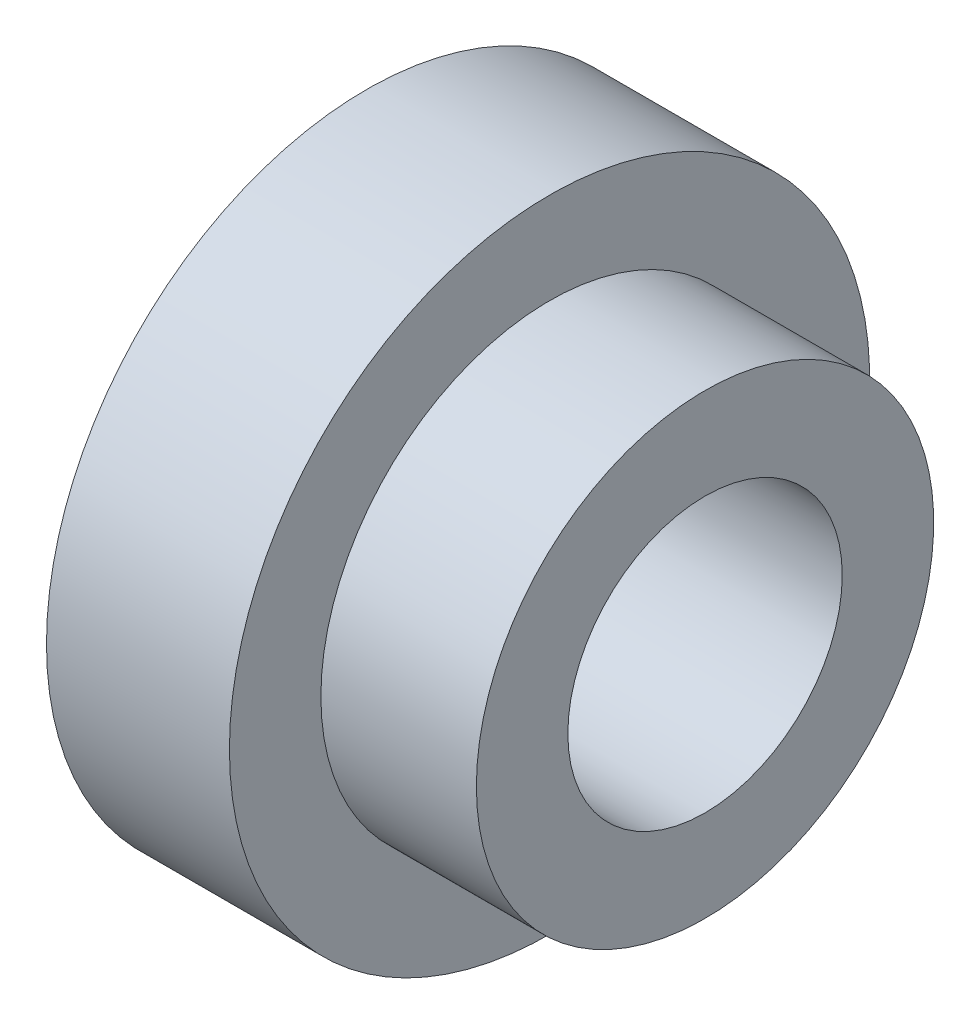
from build123d import *

# Parameters (mm, degrees)
SKETCH2_R          = 3
CUT_EXTRUDE1_DEPTH = 13.359611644


with BuildPart() as part:
    # Sketch1 → Revolve1 (revolve)
    with BuildSketch(Plane(origin=(0, 0, 0), x_dir=(1, 0, 0), z_dir=(0, 1, 0)), mode=Mode.PRIVATE) as revolve1_sk:
        Polygon((0, 0), (7.4, 0), (7.4, 5), (4, 5), (4, 7), (0, 7), align=None)
    revolve(revolve1_sk.sketch.rotate(Axis((0, 0, 0), (1, 0, 0)), 180), axis=Axis((0, 0, 0), (1, 0, 0)))

    # Sketch2 → Cut-Extrude1 (cut, through all)
    with BuildSketch(Plane(origin=(7.4, 0, 0), x_dir=(0, 0, -1), z_dir=(1, 0, 0))):
        Circle(SKETCH2_R)
    extrude(amount=-CUT_EXTRUDE1_DEPTH, mode=Mode.SUBTRACT)


solid = part.part
